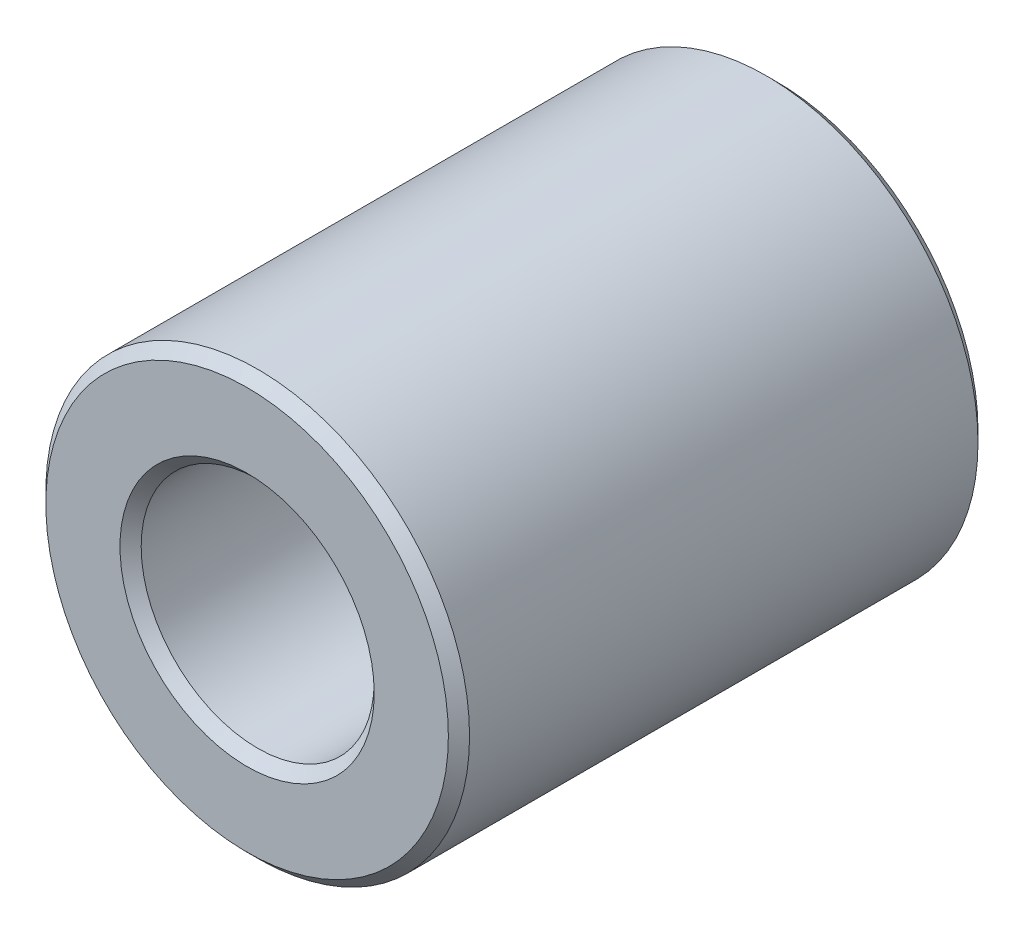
from build123d import *

# Parameters (mm, degrees)
SKETCH1_R           = 2
SKETCH1_R_2         = 1.1
BOSS_EXTRUDE2_DEPTH = 2.5
CHAMFER3_SIZE       = 0.1


with BuildPart() as part:
    # Sketch1 → Boss-Extrude2 (new, symmetric)
    with BuildSketch(Plane.XY):
        Circle(SKETCH1_R)
        Circle(SKETCH1_R_2, mode=Mode.SUBTRACT)
    extrude(amount=BOSS_EXTRUDE2_DEPTH, both=True)

    # Chamfer3
    chamfer3_edges = [part.edges().sort_by_distance(p)[0] for p in [
        (-2, 0, -2.5),
        (-2, 0, 2.5),
        (-1.1, 0, -2.5),
        (-1.1, 0, 2.5),
    ]]
    chamfer(chamfer3_edges, length=CHAMFER3_SIZE)


solid = part.part
